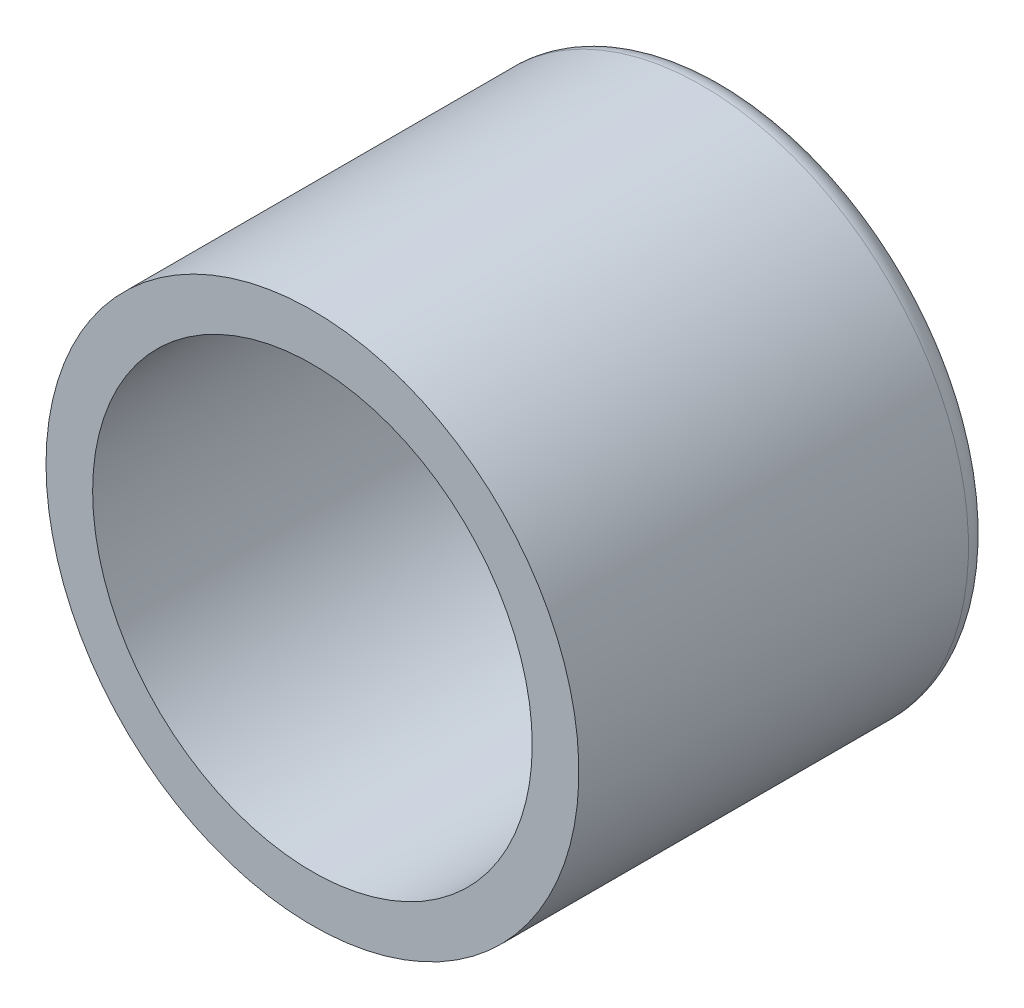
from build123d import *


with BuildPart() as part:
    # Esquisse1 → R_volution1 (revolve)
    with BuildSketch(Plane.XZ, mode=Mode.PRIVATE) as r_volution1_sk:
        with BuildLine():
            Line((6.6, 0.2), (0, 0.2))
            Line((0, 0.2), (0, 0))
            Line((0, 0), (7.3, 0))
            ThreePointArc((7.3, 0), (7.794974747, 0.205025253), (8, 0.7))
            Line((8, 0.7), (8, 12.4))
            Line((8, 12.4), (6.6, 12.4))
            Line((6.6, 12.4), (6.6, 0.2))
        make_face()
    revolve(r_volution1_sk.sketch.rotate(Axis((0, 0, 12.4), (0, 0, -1)), 180), axis=Axis((0, 0, 12.4), (0, 0, -1)))


solid = part.part
